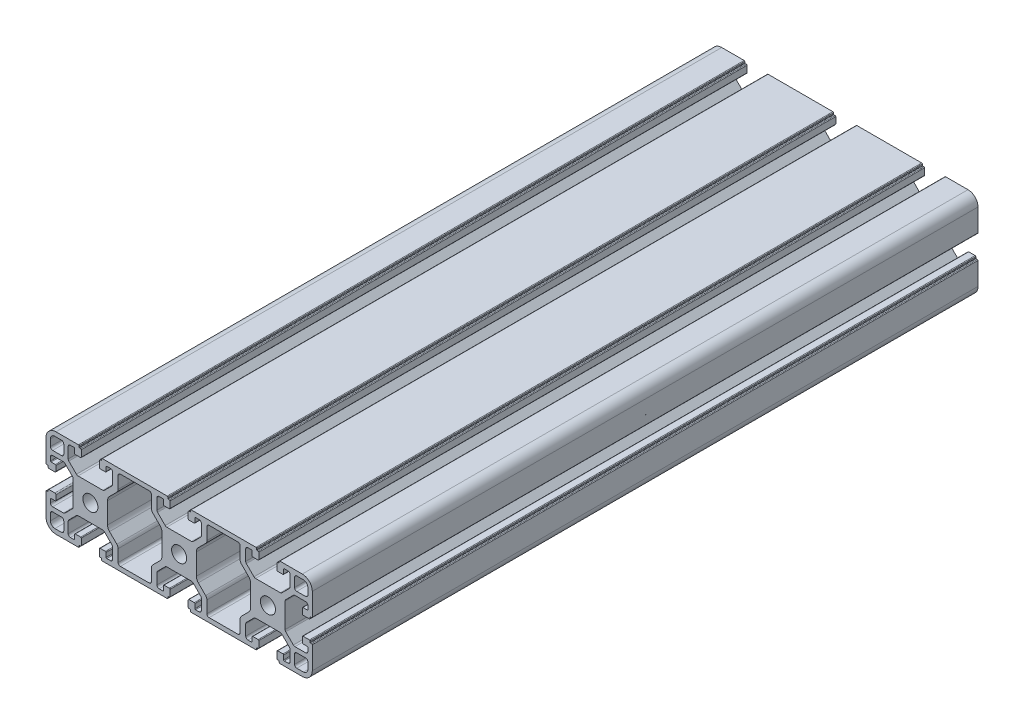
from build123d import *

# Parameters (mm, degrees)
SKETCH_1_R      = 3.4
EXTRUDE_1_DEPTH = 150


with BuildPart() as part:
    # Sketch 1 → Extrude 1 (new, symmetric)
    with BuildSketch(Plane.XY):
        with BuildLine():
            Line((-34.431980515, 7.75), (-45.568019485, 7.75))
            ThreePointArc((-45.568019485, 7.75), (-45.950702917, 7.826120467), (-46.275126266, 8.042893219))
            Line((-46.275126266, 8.042893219), (-49.707106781, 11.474873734))
            ThreePointArc((-49.707106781, 11.474873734), (-49.923879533, 11.799297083), (-50, 12.181980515))
            Line((-50, 12.181980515), (-50, 17))
            ThreePointArc((-50, 17), (-49.707106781, 17.707106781), (-49, 18))
            Line((-49, 18), (-47.1, 18))
            Line((-47.1, 18), (-47.1, 15.8))
            ThreePointArc((-47.1, 15.8), (-47.012132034, 15.587867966), (-46.8, 15.5))
            Line((-46.8, 15.5), (-44.4, 15.5))
            ThreePointArc((-44.4, 15.5), (-44.187867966, 15.587867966), (-44.1, 15.8))
            Line((-44.1, 15.8), (-44.1, 18.7))
            ThreePointArc((-44.1, 18.7), (-44.187867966, 18.912132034), (-44.4, 19))
            Line((-44.4, 19), (-44.9, 19))
            ThreePointArc((-44.9, 19), (-45.041421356, 19.058578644), (-45.1, 19.2))
            Line((-45.1, 19.2), (-45.1, 19.7))
            ThreePointArc((-45.1, 19.7), (-45.187867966, 19.912132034), (-45.4, 20))
            Line((-45.4, 20), (-55.5, 20))
            ThreePointArc((-55.5, 20), (-58.681980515, 18.681980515), (-60, 15.5))
            Line((-60, 15.5), (-60, 5.4))
            ThreePointArc((-60, 5.4), (-59.912132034, 5.187867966), (-59.7, 5.1))
            Line((-59.7, 5.1), (-59.2, 5.1))
            ThreePointArc((-59.2, 5.1), (-59.058578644, 5.041421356), (-59, 4.9))
            Line((-59, 4.9), (-59, 4.4))
            ThreePointArc((-59, 4.4), (-58.912132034, 4.187867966), (-58.7, 4.1))
            Line((-58.7, 4.1), (-56, 4.1))
            ThreePointArc((-56, 4.1), (-55.646446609, 4.246446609), (-55.5, 4.6))
            Line((-55.5, 4.6), (-55.5, 6.8))
            ThreePointArc((-55.5, 6.8), (-55.587867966, 7.012132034), (-55.8, 7.1))
            Line((-55.8, 7.1), (-57.7, 7.1))
            ThreePointArc((-57.7, 7.1), (-57.912132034, 7.187867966), (-58, 7.4))
            Line((-58, 7.4), (-58, 9))
            ThreePointArc((-58, 9), (-57.707106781, 9.707106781), (-57, 10))
            Line((-57, 10), (-52.181980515, 10))
            ThreePointArc((-52.181980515, 10), (-51.799297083, 9.923879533), (-51.474873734, 9.707106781))
            Line((-51.474873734, 9.707106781), (-48.042893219, 6.275126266))
            ThreePointArc((-48.042893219, 6.275126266), (-47.826120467, 5.950702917), (-47.75, 5.568019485))
            Line((-47.75, 5.568019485), (-47.75, -5.568019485))
            ThreePointArc((-47.75, -5.568019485), (-47.826120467, -5.950702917), (-48.042893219, -6.275126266))
            Line((-48.042893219, -6.275126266), (-51.474873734, -9.707106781))
            ThreePointArc((-51.474873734, -9.707106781), (-51.799297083, -9.923879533), (-52.181980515, -10))
            Line((-52.181980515, -10), (-57, -10))
            ThreePointArc((-57, -10), (-57.707106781, -9.707106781), (-58, -9))
            Line((-58, -9), (-58, -7.4))
            ThreePointArc((-58, -7.4), (-57.912132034, -7.187867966), (-57.7, -7.1))
            Line((-57.7, -7.1), (-55.8, -7.1))
            ThreePointArc((-55.8, -7.1), (-55.587867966, -7.012132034), (-55.5, -6.8))
            Line((-55.5, -6.8), (-55.5, -4.6))
            ThreePointArc((-55.5, -4.6), (-55.646446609, -4.246446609), (-56, -4.1))
            Line((-56, -4.1), (-58.7, -4.1))
            ThreePointArc((-58.7, -4.1), (-58.912132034, -4.187867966), (-59, -4.4))
            Line((-59, -4.4), (-59, -4.9))
            ThreePointArc((-59, -4.9), (-59.058578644, -5.041421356), (-59.2, -5.1))
            Line((-59.2, -5.1), (-59.7, -5.1))
            ThreePointArc((-59.7, -5.1), (-59.912132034, -5.187867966), (-60, -5.4))
            Line((-60, -5.4), (-60, -15.5))
            ThreePointArc((-60, -15.5), (-58.681980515, -18.681980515), (-55.5, -20))
            Line((-55.5, -20), (-45.4, -20))
            ThreePointArc((-45.4, -20), (-45.187867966, -19.912132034), (-45.1, -19.7))
            Line((-45.1, -19.7), (-45.1, -19.2))
            ThreePointArc((-45.1, -19.2), (-45.041421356, -19.058578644), (-44.9, -19))
            Line((-44.9, -19), (-44.4, -19))
            ThreePointArc((-44.4, -19), (-44.187867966, -18.912132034), (-44.1, -18.7))
            Line((-44.1, -18.7), (-44.1, -15.8))
            ThreePointArc((-44.1, -15.8), (-44.187867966, -15.587867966), (-44.4, -15.5))
            Line((-44.4, -15.5), (-46.8, -15.5))
            ThreePointArc((-46.8, -15.5), (-47.012132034, -15.587867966), (-47.1, -15.8))
            Line((-47.1, -15.8), (-47.1, -17.7))
            ThreePointArc((-47.1, -17.7), (-47.187867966, -17.912132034), (-47.4, -18))
            Line((-47.4, -18), (-49, -18))
            ThreePointArc((-49, -18), (-49.707106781, -17.707106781), (-50, -17))
            Line((-50, -17), (-50, -12.181980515))
            ThreePointArc((-50, -12.181980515), (-49.923879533, -11.799297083), (-49.707106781, -11.474873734))
            Line((-49.707106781, -11.474873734), (-46.275126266, -8.042893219))
            ThreePointArc((-46.275126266, -8.042893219), (-45.950702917, -7.826120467), (-45.568019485, -7.75))
            Line((-45.568019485, -7.75), (-34.431980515, -7.75))
            ThreePointArc((-34.431980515, -7.75), (-34.049297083, -7.826120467), (-33.724873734, -8.042893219))
            Line((-33.724873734, -8.042893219), (-30.292893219, -11.474873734))
            ThreePointArc((-30.292893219, -11.474873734), (-30.076120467, -11.799297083), (-30, -12.181980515))
            Line((-30, -12.181980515), (-30, -17))
            ThreePointArc((-30, -17), (-30.292893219, -17.707106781), (-31, -18))
            Line((-31, -18), (-32.6, -18))
            ThreePointArc((-32.6, -18), (-32.812132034, -17.912132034), (-32.9, -17.7))
            Line((-32.9, -17.7), (-32.9, -15.8))
            ThreePointArc((-32.9, -15.8), (-32.987867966, -15.587867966), (-33.2, -15.5))
            Line((-33.2, -15.5), (-35.6, -15.5))
            ThreePointArc((-35.6, -15.5), (-35.812132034, -15.587867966), (-35.9, -15.8))
            Line((-35.9, -15.8), (-35.9, -18.7))
            ThreePointArc((-35.9, -18.7), (-35.812132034, -18.912132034), (-35.6, -19))
            Line((-35.6, -19), (-35.1, -19))
            ThreePointArc((-35.1, -19), (-34.958578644, -19.058578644), (-34.9, -19.2))
            Line((-34.9, -19.2), (-34.9, -19.7))
            ThreePointArc((-34.9, -19.7), (-34.812132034, -19.912132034), (-34.6, -20))
            Line((-34.6, -20), (-5.4, -20))
            ThreePointArc((-5.4, -20), (-5.187867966, -19.912132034), (-5.1, -19.7))
            Line((-5.1, -19.7), (-5.1, -19.2))
            ThreePointArc((-5.1, -19.2), (-5.041421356, -19.058578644), (-4.9, -19))
            Line((-4.9, -19), (-4.4, -19))
            ThreePointArc((-4.4, -19), (-4.187867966, -18.912132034), (-4.1, -18.7))
            Line((-4.1, -18.7), (-4.1, -15.8))
            ThreePointArc((-4.1, -15.8), (-4.187867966, -15.587867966), (-4.4, -15.5))
            Line((-4.4, -15.5), (-6.8, -15.5))
            ThreePointArc((-6.8, -15.5), (-7.012132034, -15.587867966), (-7.1, -15.8))
            Line((-7.1, -15.8), (-7.1, -17.7))
            ThreePointArc((-7.1, -17.7), (-7.187867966, -17.912132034), (-7.4, -18))
            Line((-7.4, -18), (-9, -18))
            ThreePointArc((-9, -18), (-9.707106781, -17.707106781), (-10, -17))
            Line((-10, -17), (-10, -12.181980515))
            ThreePointArc((-10, -12.181980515), (-9.923879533, -11.799297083), (-9.707106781, -11.474873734))
            Line((-9.707106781, -11.474873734), (-6.275126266, -8.042893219))
            ThreePointArc((-6.275126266, -8.042893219), (-5.950702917, -7.826120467), (-5.568019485, -7.75))
            Line((-5.568019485, -7.75), (5.568019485, -7.75))
            ThreePointArc((5.568019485, -7.75), (5.950702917, -7.826120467), (6.275126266, -8.042893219))
            Line((6.275126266, -8.042893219), (9.707106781, -11.474873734))
            ThreePointArc((9.707106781, -11.474873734), (9.923879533, -11.799297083), (10, -12.181980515))
            Line((10, -12.181980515), (10, -17))
            ThreePointArc((10, -17), (9.707106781, -17.707106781), (9, -18))
            Line((9, -18), (7.4, -18))
            ThreePointArc((7.4, -18), (7.187867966, -17.912132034), (7.1, -17.7))
            Line((7.1, -17.7), (7.1, -15.8))
            ThreePointArc((7.1, -15.8), (7.012132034, -15.587867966), (6.8, -15.5))
            Line((6.8, -15.5), (4.4, -15.5))
            ThreePointArc((4.4, -15.5), (4.187867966, -15.587867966), (4.1, -15.8))
            Line((4.1, -15.8), (4.1, -18.7))
            ThreePointArc((4.1, -18.7), (4.187867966, -18.912132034), (4.4, -19))
            Line((4.4, -19), (4.9, -19))
            ThreePointArc((4.9, -19), (5.041421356, -19.058578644), (5.1, -19.2))
            Line((5.1, -19.2), (5.1, -19.7))
            ThreePointArc((5.1, -19.7), (5.187867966, -19.912132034), (5.4, -20))
            Line((5.4, -20), (34.6, -20))
            ThreePointArc((34.6, -20), (34.812132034, -19.912132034), (34.9, -19.7))
            Line((34.9, -19.7), (34.9, -19.2))
            ThreePointArc((34.9, -19.2), (34.958578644, -19.058578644), (35.1, -19))
            Line((35.1, -19), (35.6, -19))
            ThreePointArc((35.6, -19), (35.812132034, -18.912132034), (35.9, -18.7))
            Line((35.9, -18.7), (35.9, -15.8))
            ThreePointArc((35.9, -15.8), (35.812132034, -15.587867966), (35.6, -15.5))
            Line((35.6, -15.5), (33.2, -15.5))
            ThreePointArc((33.2, -15.5), (32.987867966, -15.587867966), (32.9, -15.8))
            Line((32.9, -15.8), (32.9, -17.7))
            ThreePointArc((32.9, -17.7), (32.812132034, -17.912132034), (32.6, -18))
            Line((32.6, -18), (31, -18))
            ThreePointArc((31, -18), (30.292893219, -17.707106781), (30, -17))
            Line((30, -17), (30, -12.181980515))
            ThreePointArc((30, -12.181980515), (30.076120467, -11.799297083), (30.292893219, -11.474873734))
            Line((30.292893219, -11.474873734), (33.724873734, -8.042893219))
            ThreePointArc((33.724873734, -8.042893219), (34.049297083, -7.826120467), (34.431980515, -7.75))
            Line((34.431980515, -7.75), (45.568019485, -7.75))
            ThreePointArc((45.568019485, -7.75), (45.950702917, -7.826120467), (46.275126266, -8.042893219))
            Line((46.275126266, -8.042893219), (49.707106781, -11.474873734))
            ThreePointArc((49.707106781, -11.474873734), (49.923879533, -11.799297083), (50, -12.181980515))
            Line((50, -12.181980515), (50, -17))
            ThreePointArc((50, -17), (49.707106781, -17.707106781), (49, -18))
            Line((49, -18), (47.4, -18))
            ThreePointArc((47.4, -18), (47.187867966, -17.912132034), (47.1, -17.7))
            Line((47.1, -17.7), (47.1, -15.8))
            ThreePointArc((47.1, -15.8), (47.012132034, -15.587867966), (46.8, -15.5))
            Line((46.8, -15.5), (44.4, -15.5))
            ThreePointArc((44.4, -15.5), (44.187867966, -15.587867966), (44.1, -15.8))
            Line((44.1, -15.8), (44.1, -18.7))
            ThreePointArc((44.1, -18.7), (44.187867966, -18.912132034), (44.4, -19))
            Line((44.4, -19), (44.9, -19))
            ThreePointArc((44.9, -19), (45.041421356, -19.058578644), (45.1, -19.2))
            Line((45.1, -19.2), (45.1, -19.7))
            ThreePointArc((45.1, -19.7), (45.187867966, -19.912132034), (45.4, -20))
            Line((45.4, -20), (55.5, -20))
            ThreePointArc((55.5, -20), (58.681980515, -18.681980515), (60, -15.5))
            Line((60, -15.5), (60, -5.4))
            ThreePointArc((60, -5.4), (59.912132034, -5.187867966), (59.7, -5.1))
            Line((59.7, -5.1), (59.2, -5.1))
            ThreePointArc((59.2, -5.1), (59.058578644, -5.041421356), (59, -4.9))
            Line((59, -4.9), (59, -4.4))
            ThreePointArc((59, -4.4), (58.912132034, -4.187867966), (58.7, -4.1))
            Line((58.7, -4.1), (55.8, -4.1))
            ThreePointArc((55.8, -4.1), (55.587867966, -4.187867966), (55.5, -4.4))
            Line((55.5, -4.4), (55.5, -6.8))
            ThreePointArc((55.5, -6.8), (55.587867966, -7.012132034), (55.8, -7.1))
            Line((55.8, -7.1), (57.7, -7.1))
            ThreePointArc((57.7, -7.1), (57.912132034, -7.187867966), (58, -7.4))
            Line((58, -7.4), (58, -9))
            ThreePointArc((58, -9), (57.707106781, -9.707106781), (57, -10))
            Line((57, -10), (52.181980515, -10))
            ThreePointArc((52.181980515, -10), (51.799297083, -9.923879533), (51.474873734, -9.707106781))
            Line((51.474873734, -9.707106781), (48.042893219, -6.275126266))
            ThreePointArc((48.042893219, -6.275126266), (47.826120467, -5.950702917), (47.75, -5.568019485))
            Line((47.75, -5.568019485), (47.75, 5.568019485))
            ThreePointArc((47.75, 5.568019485), (47.826120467, 5.950702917), (48.042893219, 6.275126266))
            Line((48.042893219, 6.275126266), (51.474873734, 9.707106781))
            ThreePointArc((51.474873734, 9.707106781), (51.799297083, 9.923879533), (52.181980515, 10))
            Line((52.181980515, 10), (57, 10))
            ThreePointArc((57, 10), (57.707106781, 9.707106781), (58, 9))
            Line((58, 9), (58, 7.4))
            ThreePointArc((58, 7.4), (57.912132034, 7.187867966), (57.7, 7.1))
            Line((57.7, 7.1), (55.8, 7.1))
            ThreePointArc((55.8, 7.1), (55.587867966, 7.012132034), (55.5, 6.8))
            Line((55.5, 6.8), (55.5, 4.4))
            ThreePointArc((55.5, 4.4), (55.587867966, 4.187867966), (55.8, 4.1))
            Line((55.8, 4.1), (58.7, 4.1))
            ThreePointArc((58.7, 4.1), (58.912132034, 4.187867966), (59, 4.4))
            Line((59, 4.4), (59, 4.9))
            ThreePointArc((59, 4.9), (59.058578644, 5.041421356), (59.2, 5.1))
            Line((59.2, 5.1), (59.7, 5.1))
            ThreePointArc((59.7, 5.1), (59.912132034, 5.187867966), (60, 5.4))
            Line((60, 5.4), (60, 15.5))
            ThreePointArc((60, 15.5), (58.681980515, 18.681980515), (55.5, 20))
            Line((55.5, 20), (45.4, 20))
            ThreePointArc((45.4, 20), (45.187867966, 19.912132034), (45.1, 19.7))
            Line((45.1, 19.7), (45.1, 19.2))
            ThreePointArc((45.1, 19.2), (45.041421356, 19.058578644), (44.9, 19))
            Line((44.9, 19), (44.4, 19))
            ThreePointArc((44.4, 19), (44.187867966, 18.912132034), (44.1, 18.7))
            Line((44.1, 18.7), (44.1, 15.8))
            ThreePointArc((44.1, 15.8), (44.187867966, 15.587867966), (44.4, 15.5))
            Line((44.4, 15.5), (46.8, 15.5))
            ThreePointArc((46.8, 15.5), (47.012132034, 15.587867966), (47.1, 15.8))
            Line((47.1, 15.8), (47.1, 17.7))
            ThreePointArc((47.1, 17.7), (47.187867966, 17.912132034), (47.4, 18))
            Line((47.4, 18), (49, 18))
            ThreePointArc((49, 18), (49.707106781, 17.707106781), (50, 17))
            Line((50, 17), (50, 12.181980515))
            ThreePointArc((50, 12.181980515), (49.923879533, 11.799297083), (49.707106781, 11.474873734))
            Line((49.707106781, 11.474873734), (46.275126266, 8.042893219))
            ThreePointArc((46.275126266, 8.042893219), (45.950702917, 7.826120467), (45.568019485, 7.75))
            Line((45.568019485, 7.75), (34.431980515, 7.75))
            ThreePointArc((34.431980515, 7.75), (34.049297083, 7.826120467), (33.724873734, 8.042893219))
            Line((33.724873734, 8.042893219), (30.292893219, 11.474873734))
            ThreePointArc((30.292893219, 11.474873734), (30.076120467, 11.799297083), (30, 12.181980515))
            Line((30, 12.181980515), (30, 17))
            ThreePointArc((30, 17), (30.292893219, 17.707106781), (31, 18))
            Line((31, 18), (32.6, 18))
            ThreePointArc((32.6, 18), (32.812132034, 17.912132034), (32.9, 17.7))
            Line((32.9, 17.7), (32.9, 15.8))
            ThreePointArc((32.9, 15.8), (32.987867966, 15.587867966), (33.2, 15.5))
            Line((33.2, 15.5), (35.6, 15.5))
            ThreePointArc((35.6, 15.5), (35.812132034, 15.587867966), (35.9, 15.8))
            Line((35.9, 15.8), (35.9, 18.7))
            ThreePointArc((35.9, 18.7), (35.812132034, 18.912132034), (35.6, 19))
            Line((35.6, 19), (35.1, 19))
            ThreePointArc((35.1, 19), (34.958578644, 19.058578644), (34.9, 19.2))
            Line((34.9, 19.2), (34.9, 19.7))
            ThreePointArc((34.9, 19.7), (34.812132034, 19.912132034), (34.6, 20))
            Line((34.6, 20), (5.4, 20))
            ThreePointArc((5.4, 20), (5.187867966, 19.912132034), (5.1, 19.7))
            Line((5.1, 19.7), (5.1, 19.2))
            ThreePointArc((5.1, 19.2), (5.041421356, 19.058578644), (4.9, 19))
            Line((4.9, 19), (4.4, 19))
            ThreePointArc((4.4, 19), (4.187867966, 18.912132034), (4.1, 18.7))
            Line((4.1, 18.7), (4.1, 15.8))
            ThreePointArc((4.1, 15.8), (4.187867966, 15.587867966), (4.4, 15.5))
            Line((4.4, 15.5), (6.8, 15.5))
            ThreePointArc((6.8, 15.5), (7.012132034, 15.587867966), (7.1, 15.8))
            Line((7.1, 15.8), (7.1, 17.7))
            ThreePointArc((7.1, 17.7), (7.187867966, 17.912132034), (7.4, 18))
            Line((7.4, 18), (9, 18))
            ThreePointArc((9, 18), (9.707106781, 17.707106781), (10, 17))
            Line((10, 17), (10, 12.181980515))
            ThreePointArc((10, 12.181980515), (9.923879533, 11.799297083), (9.707106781, 11.474873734))
            Line((9.707106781, 11.474873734), (6.275126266, 8.042893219))
            ThreePointArc((6.275126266, 8.042893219), (5.950702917, 7.826120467), (5.568019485, 7.75))
            Line((5.568019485, 7.75), (-5.568019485, 7.75))
            ThreePointArc((-5.568019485, 7.75), (-5.950702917, 7.826120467), (-6.275126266, 8.042893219))
            Line((-6.275126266, 8.042893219), (-9.707106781, 11.474873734))
            ThreePointArc((-9.707106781, 11.474873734), (-9.923879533, 11.799297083), (-10, 12.181980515))
            Line((-10, 12.181980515), (-10, 17))
            ThreePointArc((-10, 17), (-9.707106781, 17.707106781), (-9, 18))
            Line((-9, 18), (-7.4, 18))
            ThreePointArc((-7.4, 18), (-7.187867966, 17.912132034), (-7.1, 17.7))
            Line((-7.1, 17.7), (-7.1, 15.8))
            ThreePointArc((-7.1, 15.8), (-7.012132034, 15.587867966), (-6.8, 15.5))
            Line((-6.8, 15.5), (-4.4, 15.5))
            ThreePointArc((-4.4, 15.5), (-4.187867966, 15.587867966), (-4.1, 15.8))
            Line((-4.1, 15.8), (-4.1, 18.7))
            ThreePointArc((-4.1, 18.7), (-4.187867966, 18.912132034), (-4.4, 19))
            Line((-4.4, 19), (-4.9, 19))
            ThreePointArc((-4.9, 19), (-5.041421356, 19.058578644), (-5.1, 19.2))
            Line((-5.1, 19.2), (-5.1, 19.7))
            ThreePointArc((-5.1, 19.7), (-5.187867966, 19.912132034), (-5.4, 20))
            Line((-5.4, 20), (-34.6, 20))
            ThreePointArc((-34.6, 20), (-34.812132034, 19.912132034), (-34.9, 19.7))
            Line((-34.9, 19.7), (-34.9, 19.2))
            ThreePointArc((-34.9, 19.2), (-34.958578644, 19.058578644), (-35.1, 19))
            Line((-35.1, 19), (-35.6, 19))
            ThreePointArc((-35.6, 19), (-35.812132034, 18.912132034), (-35.9, 18.7))
            Line((-35.9, 18.7), (-35.9, 15.8))
            ThreePointArc((-35.9, 15.8), (-35.812132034, 15.587867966), (-35.6, 15.5))
            Line((-35.6, 15.5), (-33.2, 15.5))
            ThreePointArc((-33.2, 15.5), (-32.987867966, 15.587867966), (-32.9, 15.8))
            Line((-32.9, 15.8), (-32.9, 17.7))
            ThreePointArc((-32.9, 17.7), (-32.812132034, 17.912132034), (-32.6, 18))
            Line((-32.6, 18), (-31, 18))
            ThreePointArc((-31, 18), (-30.292893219, 17.707106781), (-30, 17))
            Line((-30, 17), (-30, 12.181980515))
            ThreePointArc((-30, 12.181980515), (-30.076120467, 11.799297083), (-30.292893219, 11.474873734))
            Line((-30.292893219, 11.474873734), (-33.724873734, 8.042893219))
            ThreePointArc((-33.724873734, 8.042893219), (-34.049297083, 7.826120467), (-34.431980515, 7.75))
        make_face()
        with Locations((40, 0)):
            Circle(SKETCH_1_R, mode=Mode.SUBTRACT)
        Circle(SKETCH_1_R, mode=Mode.SUBTRACT)
        with Locations((-40, 0)):
            Circle(SKETCH_1_R, mode=Mode.SUBTRACT)
        with BuildLine():
            Line((11.927702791, 10.159935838), (8.628679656, 6.860912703))
            ThreePointArc((8.628679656, 6.860912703), (7.978361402, 5.887642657), (7.75, 4.73959236))
            Line((7.75, 4.73959236), (7.75, -4.73959236))
            ThreePointArc((7.75, -4.73959236), (7.978361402, -5.887642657), (8.628679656, -6.860912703))
            Line((8.628679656, -6.860912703), (11.927702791, -10.159935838))
            ThreePointArc((11.927702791, -10.159935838), (12.361248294, -10.808782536), (12.513489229, -11.574149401))
            Line((12.513489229, -11.574149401), (12.513489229, -17))
            ThreePointArc((12.513489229, -17), (12.806382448, -17.707106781), (13.513489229, -18))
            Line((13.513489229, -18), (26.486510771, -18))
            ThreePointArc((26.486510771, -18), (27.193617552, -17.707106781), (27.486510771, -17))
            Line((27.486510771, -17), (27.486510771, -11.574149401))
            ThreePointArc((27.486510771, -11.574149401), (27.638751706, -10.808782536), (28.072297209, -10.159935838))
            Line((28.072297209, -10.159935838), (31.371320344, -6.860912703))
            ThreePointArc((31.371320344, -6.860912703), (32.021638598, -5.887642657), (32.25, -4.73959236))
            Line((32.25, -4.73959236), (32.25, 4.73959236))
            ThreePointArc((32.25, 4.73959236), (32.021638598, 5.887642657), (31.371320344, 6.860912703))
            Line((31.371320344, 6.860912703), (28.072297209, 10.159935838))
            ThreePointArc((28.072297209, 10.159935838), (27.638751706, 10.808782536), (27.486510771, 11.574149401))
            Line((27.486510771, 11.574149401), (27.486510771, 17))
            ThreePointArc((27.486510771, 17), (27.193617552, 17.707106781), (26.486510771, 18))
            Line((26.486510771, 18), (13.513489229, 18))
            ThreePointArc((13.513489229, 18), (12.806382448, 17.707106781), (12.513489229, 17))
            Line((12.513489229, 17), (12.513489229, 11.574149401))
            ThreePointArc((12.513489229, 11.574149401), (12.361248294, 10.808782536), (11.927702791, 10.159935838))
        make_face(mode=Mode.SUBTRACT)
        with BuildLine():
            Line((-28.072297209, 10.159935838), (-31.371320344, 6.860912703))
            ThreePointArc((-31.371320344, 6.860912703), (-32.021638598, 5.887642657), (-32.25, 4.73959236))
            Line((-32.25, 4.73959236), (-32.25, -4.73959236))
            ThreePointArc((-32.25, -4.73959236), (-32.021638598, -5.887642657), (-31.371320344, -6.860912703))
            Line((-31.371320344, -6.860912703), (-28.072297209, -10.159935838))
            ThreePointArc((-28.072297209, -10.159935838), (-27.638751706, -10.808782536), (-27.486510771, -11.574149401))
            Line((-27.486510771, -11.574149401), (-27.486510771, -17))
            ThreePointArc((-27.486510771, -17), (-27.193617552, -17.707106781), (-26.486510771, -18))
            Line((-26.486510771, -18), (-13.513489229, -18))
            ThreePointArc((-13.513489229, -18), (-12.806382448, -17.707106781), (-12.513489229, -17))
            Line((-12.513489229, -17), (-12.513489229, -11.574149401))
            ThreePointArc((-12.513489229, -11.574149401), (-12.361248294, -10.808782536), (-11.927702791, -10.159935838))
            Line((-11.927702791, -10.159935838), (-8.628679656, -6.860912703))
            ThreePointArc((-8.628679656, -6.860912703), (-7.978361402, -5.887642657), (-7.75, -4.73959236))
            Line((-7.75, -4.73959236), (-7.75, 4.73959236))
            ThreePointArc((-7.75, 4.73959236), (-7.978361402, 5.887642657), (-8.628679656, 6.860912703))
            Line((-8.628679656, 6.860912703), (-11.927702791, 10.159935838))
            ThreePointArc((-11.927702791, 10.159935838), (-12.361248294, 10.808782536), (-12.513489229, 11.574149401))
            Line((-12.513489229, 11.574149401), (-12.513489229, 17))
            ThreePointArc((-12.513489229, 17), (-12.806382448, 17.707106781), (-13.513489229, 18))
            Line((-13.513489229, 18), (-26.486510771, 18))
            ThreePointArc((-26.486510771, 18), (-27.193617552, 17.707106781), (-27.486510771, 17))
            Line((-27.486510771, 17), (-27.486510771, 11.574149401))
            ThreePointArc((-27.486510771, 11.574149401), (-27.638751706, 10.808782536), (-28.072297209, 10.159935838))
        make_face(mode=Mode.SUBTRACT)
        with BuildLine():
            Line((58, -16), (58, -13))
            ThreePointArc((58, -13), (57.707106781, -12.292893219), (57, -12))
            Line((57, -12), (53, -12))
            ThreePointArc((53, -12), (52.292893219, -12.292893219), (52, -13))
            Line((52, -13), (52, -17))
            ThreePointArc((52, -17), (52.292893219, -17.707106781), (53, -18))
            Line((53, -18), (56, -18))
            ThreePointArc((56, -18), (57.414213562, -17.414213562), (58, -16))
        make_face(mode=Mode.SUBTRACT)
        with BuildLine():
            Line((52, 17), (52, 13))
            ThreePointArc((52, 13), (52.292893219, 12.292893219), (53, 12))
            Line((53, 12), (57, 12))
            ThreePointArc((57, 12), (57.707106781, 12.292893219), (58, 13))
            Line((58, 13), (58, 16))
            ThreePointArc((58, 16), (57.414213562, 17.414213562), (56, 18))
            Line((56, 18), (53, 18))
            ThreePointArc((53, 18), (52.292893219, 17.707106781), (52, 17))
        make_face(mode=Mode.SUBTRACT)
        with BuildLine():
            Line((-57, 12), (-53, 12))
            ThreePointArc((-53, 12), (-52.292893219, 12.292893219), (-52, 13))
            Line((-52, 13), (-52, 17))
            ThreePointArc((-52, 17), (-52.292893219, 17.707106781), (-53, 18))
            Line((-53, 18), (-56, 18))
            ThreePointArc((-56, 18), (-57.414213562, 17.414213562), (-58, 16))
            Line((-58, 16), (-58, 13))
            ThreePointArc((-58, 13), (-57.707106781, 12.292893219), (-57, 12))
        make_face(mode=Mode.SUBTRACT)
        with BuildLine():
            Line((-58, -13), (-58, -16))
            ThreePointArc((-58, -16), (-57.414213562, -17.414213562), (-56, -18))
            Line((-56, -18), (-53, -18))
            ThreePointArc((-53, -18), (-52.292893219, -17.707106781), (-52, -17))
            Line((-52, -17), (-52, -13))
            ThreePointArc((-52, -13), (-52.292893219, -12.292893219), (-53, -12))
            Line((-53, -12), (-57, -12))
            ThreePointArc((-57, -12), (-57.707106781, -12.292893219), (-58, -13))
        make_face(mode=Mode.SUBTRACT)
    extrude(amount=EXTRUDE_1_DEPTH, both=True)


solid = part.part
